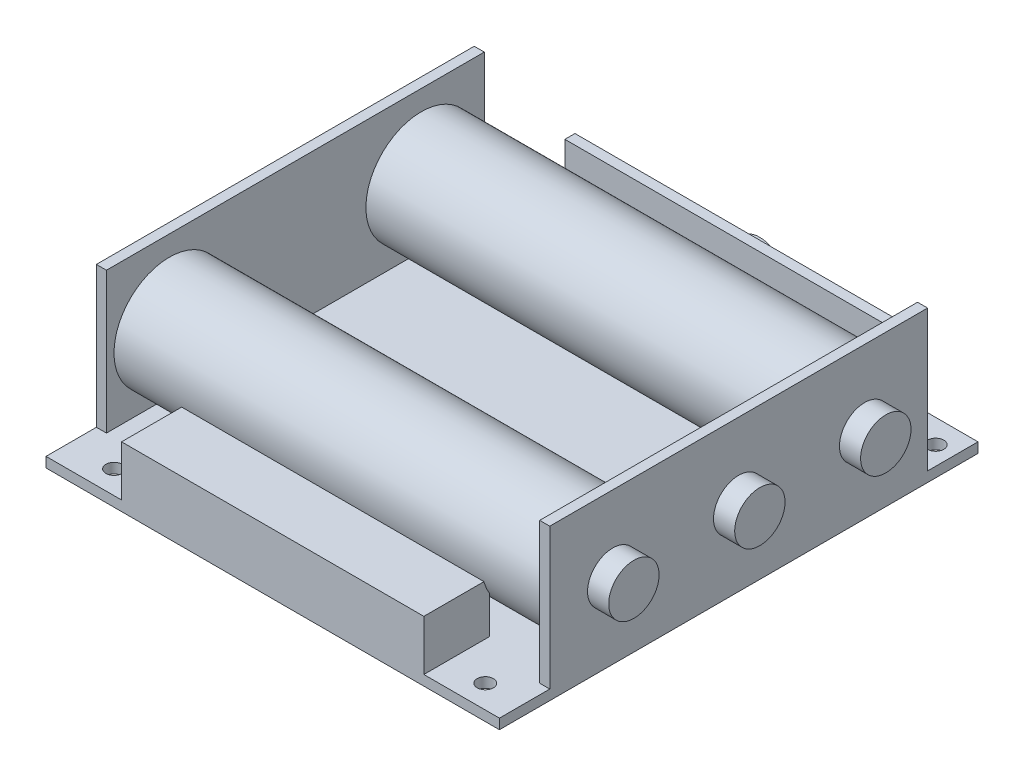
from build123d import *

# Parameters (mm, degrees)
SKETCH1_W                  = 90
SKETCH1_H                  = 95
BOSS_EXTRUDE1_DEPTH        = 2
F_3_2_3_2_DIAMETER_HOLE1_D = 3.2
SKETCH4_W                  = 75
SKETCH4_H                  = 30
BOSS_EXTRUDE2_DEPTH        = 2
BOSS_EXTRUDE3_DEPTH        = 4.2
BOSS_EXTRUDE3_DEPTH_BACK   = 94.2
SKETCH5_R                  = 5
SKETCH6_W                  = 60
SKETCH6_H                  = 13
BOSS_EXTRUDE4_DEPTH        = 10
SKETCH7_R                  = 5
BOSS_EXTRUDE5_DEPTH        = 4.2
SKETCH8_W                  = 70
SKETCH8_H                  = 15
BOSS_EXTRUDE6_DEPTH        = 2
SKETCH9_R                  = 5
BOSS_EXTRUDE7_DEPTH        = 4.2


with BuildPart() as part:
    # Sketch1 → Boss-Extrude1 (new body)
    with BuildSketch(Plane(origin=(0, 0, 0), x_dir=(1, 0, 0), z_dir=(0, 1, 0))):
        Rectangle(SKETCH1_W, SKETCH1_H)
    extrude(amount=BOSS_EXTRUDE1_DEPTH)

    # 3.2 _3.2_ Diameter Hole1 (through all)
    with Locations(Plane(origin=(0, 0, 0), x_dir=(-1, 0, 0), z_dir=(0, -1, 0))):
        with Locations((36.1, -42.9), (-37.6, -42.9), (-41.3, 42.8), (38.7, 42.8)):
            Hole(F_3_2_3_2_DIAMETER_HOLE1_D / 2)

    # Sketch4 → Boss-Extrude2 (add)
    with BuildSketch(Plane(origin=(45, 0, 0), x_dir=(0, 0, -1), z_dir=(1, 0, 0))):
        with Locations((0, 15)):
            Rectangle(SKETCH4_W, SKETCH4_H)
    boss_extrude2 = extrude(amount=-BOSS_EXTRUDE2_DEPTH)

    # Mirror1: Boss-Extrude2 across plane
    add(boss_extrude2.mirror(Plane(origin=(0, 0, 0), x_dir=(0, 0, 1), z_dir=(1, 0, 0))))

    # Sketch5 → Boss-Extrude3 (add, two sides: drawn at the far end of the back side and taken through both)
    with BuildSketch(Plane(origin=(45, 0, 0), x_dir=(0, 0, -1), z_dir=(1, 0, 0)).offset(-BOSS_EXTRUDE3_DEPTH_BACK)):
        with Locations((-25, 15)):
            Circle(SKETCH5_R)
        with Locations((25, 15)):
            Circle(SKETCH5_R)
    extrude(amount=BOSS_EXTRUDE3_DEPTH + BOSS_EXTRUDE3_DEPTH_BACK)

    # Sketch6 → Boss-Extrude4 (add)
    with BuildSketch(Plane(origin=(0, 2, 0), x_dir=(1, 0, 0), z_dir=(0, 1, 0))):
        with Locations((0, -41)):
            Rectangle(SKETCH6_W, SKETCH6_H)
    extrude(amount=BOSS_EXTRUDE4_DEPTH)

    # Sketch7 → Boss-Extrude5 (add)
    with BuildSketch(Plane.ZY.offset(45)):
        with Locations(Location((0, 15, 0), (0, 0, 180))):
            Circle(SKETCH7_R)
    boss_extrude5 = extrude(amount=BOSS_EXTRUDE5_DEPTH)

    # Mirror2: Boss-Extrude5 across plane
    add(boss_extrude5.mirror(Plane(origin=(0, 0, 0), x_dir=(0, 0, 1), z_dir=(1, 0, 0))))

    # Sketch8 → Boss-Extrude6 (add)
    with BuildSketch(Plane(origin=(0, 0, -47.5), x_dir=(-1, 0, 0), z_dir=(0, 0, -1))):
        with Locations((0, 7.5)):
            Rectangle(SKETCH8_W, SKETCH8_H)
    extrude(amount=-BOSS_EXTRUDE6_DEPTH)

    # Sketch9 → Boss-Extrude7 (add)
    with BuildSketch(Plane(origin=(0, 0, -47.5), x_dir=(-1, 0, 0), z_dir=(0, 0, -1))):
        with Locations(Location((2.55, 6.3, 0), (0, 0, 180))):
            Circle(SKETCH9_R)
    extrude(amount=BOSS_EXTRUDE7_DEPTH)


solid = part.part
